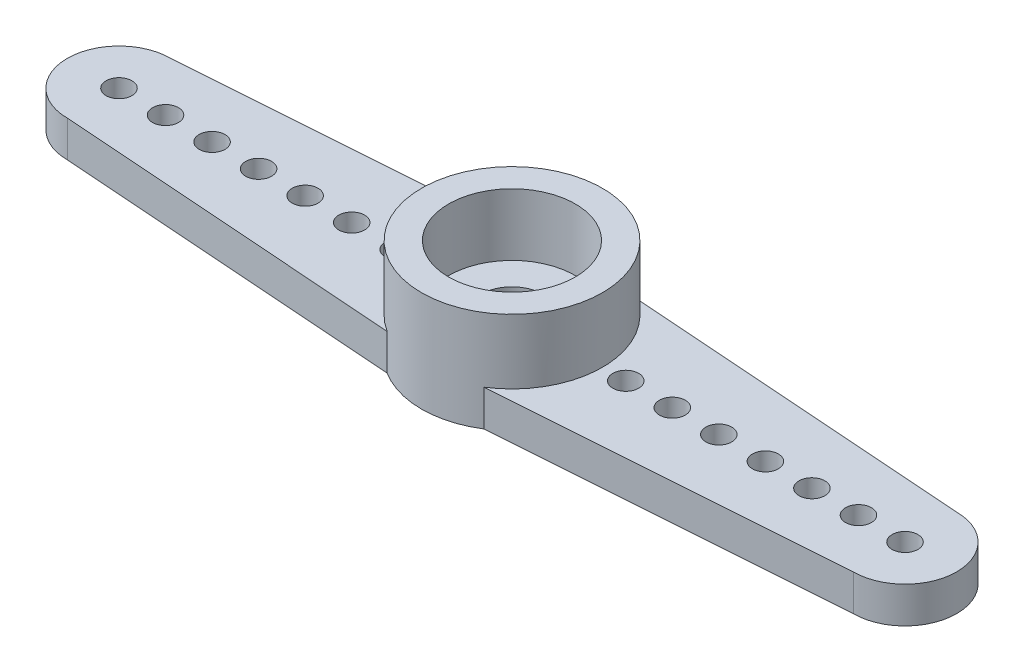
from build123d import *

# Parameters (mm, degrees)
SKETCH1_R           = 0.5
BOSS_EXTRUDE1_DEPTH = 1.4
SKETCH2_R           = 2.35
CUT_EXTRUDE1_DEPTH  = 1
SKETCH3_R           = 3.5
SKETCH3_R_2         = 2.45
BOSS_EXTRUDE2_DEPTH = 2.5
SKETCH4_R           = 1.2
CUT_EXTRUDE2_DEPTH  = 20.282440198
SKETCH5_R           = 2.45
SKETCH5_R_2         = 1.2
BOSS_EXTRUDE3_DEPTH = 0.1
SKETCH6_W           = 35.735260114
SKETCH6_H           = 17.672039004
CUT_EXTRUDE4_DEPTH  = 20.513392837


with BuildPart() as part:
    # Sketch1 → Boss-Extrude1 (new body)
    with BuildSketch(Plane(origin=(0, 0, 0), x_dir=(1, 0, 0), z_dir=(0, 1, 0))):
        with BuildLine():
            Line((-15.2, 2), (-2, 2.95))
            Line((-2, 2.95), (-2, 6.35))
            ThreePointArc((-2, 6.35), (0, 8.35), (2, 6.35))
            Line((2, 6.35), (2, 3.5))
            Line((2, 3.5), (15.2, 2))
            ThreePointArc((15.2, 2), (17.2, 0), (15.2, -2))
            Line((15.2, -2), (2, -3.5))
            Line((2, -3.5), (2, -6.35))
            ThreePointArc((2, -6.35), (0, -8.35), (-2, -6.35))
            Line((-2, -6.35), (-2, -2.95))
            Line((-2, -2.95), (-15.2, -2))
            ThreePointArc((-15.2, -2), (-17.2, 0), (-15.2, 2))
        make_face()
        with Locations(Location((0, 6.35, 0), (0, 0, 270))):
            Circle(SKETCH1_R, mode=Mode.SUBTRACT)
        with Locations(Location((0, 4.55, 0), (0, 0, 270))):
            Circle(SKETCH1_R, mode=Mode.SUBTRACT)
        with Locations(Location((0, -4.55, 0), (0, 0, 90))):
            Circle(SKETCH1_R, mode=Mode.SUBTRACT)
        with Locations(Location((0, -6.35, 0), (0, 0, 90))):
            Circle(SKETCH1_R, mode=Mode.SUBTRACT)
        with Locations(Location((-15.2, 0, 0), (0, 0, 270))):
            Circle(SKETCH1_R, mode=Mode.SUBTRACT)
        with Locations(Location((15.2, 0, 0), (0, 0, 270))):
            Circle(SKETCH1_R, mode=Mode.SUBTRACT)
        with Locations(Location((-13.4, 0, 0), (0, 0, 270))):
            Circle(SKETCH1_R, mode=Mode.SUBTRACT)
        with Locations(Location((-11.6, 0, 0), (0, 0, 270))):
            Circle(SKETCH1_R, mode=Mode.SUBTRACT)
        with Locations(Location((-9.8, 0, 0), (0, 0, 270))):
            Circle(SKETCH1_R, mode=Mode.SUBTRACT)
        with Locations(Location((-8, 0, 0), (0, 0, 270))):
            Circle(SKETCH1_R, mode=Mode.SUBTRACT)
        with Locations(Location((-6.2, 0, 0), (0, 0, 270))):
            Circle(SKETCH1_R, mode=Mode.SUBTRACT)
        with Locations(Location((-4.4, 0, 0), (0, 0, 270))):
            Circle(SKETCH1_R, mode=Mode.SUBTRACT)
        with Locations(Location((13.4, 0, 0), (0, 0, 270))):
            Circle(SKETCH1_R, mode=Mode.SUBTRACT)
        with Locations(Location((11.6, 0, 0), (0, 0, 270))):
            Circle(SKETCH1_R, mode=Mode.SUBTRACT)
        with Locations(Location((9.8, 0, 0), (0, 0, 270))):
            Circle(SKETCH1_R, mode=Mode.SUBTRACT)
        with Locations(Location((8, 0, 0), (0, 0, 270))):
            Circle(SKETCH1_R, mode=Mode.SUBTRACT)
        with Locations(Location((6.2, 0, 0), (0, 0, 270))):
            Circle(SKETCH1_R, mode=Mode.SUBTRACT)
        with Locations(Location((4.4, 0, 0), (0, 0, 270))):
            Circle(SKETCH1_R, mode=Mode.SUBTRACT)
    extrude(amount=BOSS_EXTRUDE1_DEPTH)

    # Sketch2 → Cut-Extrude1 (cut)
    with BuildSketch(Plane.XZ):
        with Locations(Location((0, 0, 0), (0, 0, 270))):
            Circle(SKETCH2_R)
    extrude(amount=-CUT_EXTRUDE1_DEPTH, mode=Mode.SUBTRACT)

    # Sketch3 → Boss-Extrude2 (add)
    with BuildSketch(Plane(origin=(0, 1.4, 0), x_dir=(1, 0, 0), z_dir=(0, 1, 0))):
        with Locations(Location((0, 0, 0), (0, 0, 270))):
            Circle(SKETCH3_R)
        with Locations(Location((0, 0, 0), (0, 0, 270))):
            Circle(SKETCH3_R_2, mode=Mode.SUBTRACT)
    extrude(amount=BOSS_EXTRUDE2_DEPTH)

    # Sketch4 → Cut-Extrude2 (cut, through all)
    with BuildSketch(Plane(origin=(0, 1.4, 0), x_dir=(1, 0, 0), z_dir=(0, 1, 0))):
        with Locations(Location((0, 0, 0), (0, 0, 270))):
            Circle(SKETCH4_R)
    extrude(amount=-CUT_EXTRUDE2_DEPTH, mode=Mode.SUBTRACT)

    # Sketch5 → Boss-Extrude3 (add)
    with BuildSketch(Plane(origin=(0, 1.4, 0), x_dir=(1, 0, 0), z_dir=(0, 1, 0))):
        with Locations(Location((0, 0, 0), (0, 0, 270))):
            Circle(SKETCH5_R)
        with Locations(Location((0, 0, 0), (0, 0, 270))):
            Circle(SKETCH5_R_2, mode=Mode.SUBTRACT)
    extrude(amount=BOSS_EXTRUDE3_DEPTH)

    # Sketch6 → Cut-Extrude4 (cut, through all)
    with BuildSketch(Plane.XZ):
        Rectangle(SKETCH6_W, SKETCH6_H)
        with BuildLine():
            Line((-1.868584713, -2.959457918), (-15.2, -2))
            ThreePointArc((-15.2, -2), (-17.2, 0), (-15.2, 2))
            Line((-15.2, 2), (-1.868584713, 2.959457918))
            ThreePointArc((-1.868584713, 2.959457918), (0, 3.5), (1.868584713, 2.959457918))
            Line((1.868584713, 2.959457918), (15.2, 2))
            ThreePointArc((15.2, 2), (17.2, 0), (15.2, -2))
            Line((15.2, -2), (1.868584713, -2.959457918))
            ThreePointArc((1.868584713, -2.959457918), (0, -3.5), (-1.868584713, -2.959457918))
        make_face(mode=Mode.SUBTRACT)
    extrude(amount=-CUT_EXTRUDE4_DEPTH, mode=Mode.SUBTRACT)


solid = part.part
